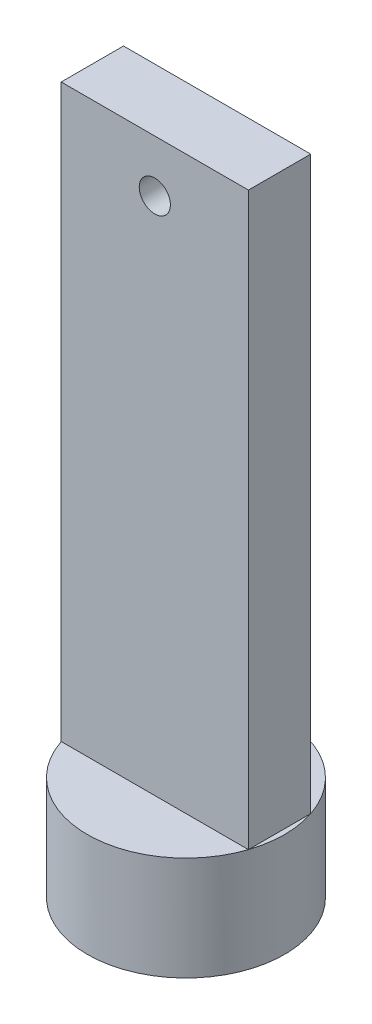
ISO-10303-21;
HEADER;
FILE_DESCRIPTION(('STEP AP214'),'2;1');
FILE_NAME('part.step','',(''),(''),'','','');
FILE_SCHEMA(('AUTOMOTIVE_DESIGN { 1 0 10303 214 1 1 1 1 }'));
ENDSEC;
DATA;
#1=APPLICATION_CONTEXT('core data for automotive mechanical design processes');
#2=APPLICATION_PROTOCOL_DEFINITION('international standard','automotive_design',2000,#1);
#3=PRODUCT_CONTEXT('',#1,'mechanical');
#4=PRODUCT('Part','Part','',(#3));
#5=PRODUCT_RELATED_PRODUCT_CATEGORY('part','',(#4));
#6=PRODUCT_DEFINITION_FORMATION('','',#4);
#7=PRODUCT_DEFINITION_CONTEXT('part definition',#1,'design');
#8=PRODUCT_DEFINITION('design','',#6,#7);
#9=PRODUCT_DEFINITION_SHAPE('','',#8);
#10=(LENGTH_UNIT() NAMED_UNIT(*) SI_UNIT(.MILLI.,.METRE.));
#11=(NAMED_UNIT(*) PLANE_ANGLE_UNIT() SI_UNIT($,.RADIAN.));
#12=(NAMED_UNIT(*) SI_UNIT($,.STERADIAN.) SOLID_ANGLE_UNIT());
#13=UNCERTAINTY_MEASURE_WITH_UNIT(LENGTH_MEASURE(1.E-05),#10,'distance_accuracy_value','');
#14=(GEOMETRIC_REPRESENTATION_CONTEXT(3) GLOBAL_UNCERTAINTY_ASSIGNED_CONTEXT((#13)) GLOBAL_UNIT_ASSIGNED_CONTEXT((#10,
#11,#12)) REPRESENTATION_CONTEXT('',''));
#15=CARTESIAN_POINT('',(0.,0.,0.));
#16=DIRECTION('',(0.,0.,1.));
#17=DIRECTION('',(1.,0.,0.));
#18=AXIS2_PLACEMENT_3D('',#15,#16,#17);
#19=CARTESIAN_POINT('',(0.,500.,0.));
#20=DIRECTION('',(0.,1.,0.));
#21=DIRECTION('',(0.,0.,1.));
#22=AXIS2_PLACEMENT_3D('',#19,#20,#21);
#23=PLANE('',#22);
#24=DIRECTION('',(0.,0.,1.));
#25=VECTOR('',#24,1.);
#26=CARTESIAN_POINT('',(-450.693909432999,500.,-150.));
#27=LINE('',#26,#25);
#28=CARTESIAN_POINT('',(-450.693909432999,500.,-150.));
#29=VERTEX_POINT('',#28);
#30=CARTESIAN_POINT('',(-450.693909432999,500.,150.));
#31=VERTEX_POINT('',#30);
#32=EDGE_CURVE('E56',#29,#31,#27,.T.);
#33=ORIENTED_EDGE('',*,*,#32,.F.);
#34=CARTESIAN_POINT('',(0.,500.,0.));
#35=DIRECTION('',(0.,1.,0.));
#36=DIRECTION('',(0.,0.,1.));
#37=AXIS2_PLACEMENT_3D('',#34,#35,#36);
#38=CIRCLE('',#37,475.);
#39=EDGE_CURVE('E114',#29,#31,#38,.T.);
#40=ORIENTED_EDGE('',*,*,#39,.T.);
#41=EDGE_LOOP('',(#33,#40));
#42=FACE_BOUND('',#41,.T.);
#43=ADVANCED_FACE('F32',(#42),#23,.T.);
#44=DIRECTION('',(-1.,0.,0.));
#45=VECTOR('',#44,1.);
#46=CARTESIAN_POINT('',(-450.693909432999,500.,-150.));
#47=LINE('',#46,#45);
#48=CARTESIAN_POINT('',(450.693909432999,500.,-150.));
#49=VERTEX_POINT('',#48);
#50=EDGE_CURVE('E97',#49,#29,#47,.T.);
#51=ORIENTED_EDGE('',*,*,#50,.F.);
#52=EDGE_CURVE('E41',#49,#29,#38,.T.);
#53=ORIENTED_EDGE('',*,*,#52,.T.);
#54=EDGE_LOOP('',(#51,#53));
#55=FACE_BOUND('',#54,.T.);
#56=ADVANCED_FACE('F120',(#55),#23,.T.);
#57=DIRECTION('',(0.,0.,-1.));
#58=VECTOR('',#57,1.);
#59=CARTESIAN_POINT('',(450.693909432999,500.,-150.));
#60=LINE('',#59,#58);
#61=CARTESIAN_POINT('',(450.693909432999,500.,150.));
#62=VERTEX_POINT('',#61);
#63=EDGE_CURVE('E127',#62,#49,#60,.T.);
#64=ORIENTED_EDGE('',*,*,#63,.F.);
#65=EDGE_CURVE('E11',#62,#49,#38,.T.);
#66=ORIENTED_EDGE('',*,*,#65,.T.);
#67=EDGE_LOOP('',(#64,#66));
#68=FACE_BOUND('',#67,.T.);
#69=ADVANCED_FACE('F162',(#68),#23,.T.);
#70=DIRECTION('',(1.,0.,0.));
#71=VECTOR('',#70,1.);
#72=CARTESIAN_POINT('',(-450.693909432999,500.,150.));
#73=LINE('',#72,#71);
#74=EDGE_CURVE('E49',#31,#62,#73,.T.);
#75=ORIENTED_EDGE('',*,*,#74,.F.);
#76=EDGE_CURVE('E43',#31,#62,#38,.T.);
#77=ORIENTED_EDGE('',*,*,#76,.T.);
#78=EDGE_LOOP('',(#75,#77));
#79=FACE_BOUND('',#78,.T.);
#80=ADVANCED_FACE('F158',(#79),#23,.T.);
#81=CARTESIAN_POINT('',(0.,0.,0.));
#82=DIRECTION('',(0.,1.,0.));
#83=DIRECTION('',(0.,0.,1.));
#84=AXIS2_PLACEMENT_3D('',#81,#82,#83);
#85=PLANE('',#84);
#86=CARTESIAN_POINT('',(0.,0.,0.));
#87=DIRECTION('',(0.,1.,0.));
#88=DIRECTION('',(0.,0.,1.));
#89=AXIS2_PLACEMENT_3D('',#86,#87,#88);
#90=CIRCLE('',#89,475.);
#91=CARTESIAN_POINT('',(0.,0.,475.));
#92=VERTEX_POINT('',#91);
#93=EDGE_CURVE('E110',#92,#92,#90,.T.);
#94=ORIENTED_EDGE('',*,*,#93,.F.);
#95=EDGE_LOOP('',(#94));
#96=FACE_BOUND('',#95,.T.);
#97=CARTESIAN_POINT('',(0.,0.,0.));
#98=DIRECTION('',(0.,1.,0.));
#99=DIRECTION('',(0.,0.,1.));
#100=AXIS2_PLACEMENT_3D('',#97,#98,#99);
#101=CIRCLE('',#100,45.5134517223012);
#102=CARTESIAN_POINT('',(0.,0.,45.5134517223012));
#103=VERTEX_POINT('',#102);
#104=EDGE_CURVE('E103',#103,#103,#101,.T.);
#105=ORIENTED_EDGE('',*,*,#104,.T.);
#106=EDGE_LOOP('',(#105));
#107=FACE_BOUND('',#106,.T.);
#108=ADVANCED_FACE('F165',(#96,#107),#85,.F.);
#109=CARTESIAN_POINT('',(0.,500.,0.));
#110=DIRECTION('',(0.,-1.,0.));
#111=DIRECTION('',(0.,0.,-1.));
#112=AXIS2_PLACEMENT_3D('',#109,#110,#111);
#113=CYLINDRICAL_SURFACE('',#112,475.);
#114=ORIENTED_EDGE('',*,*,#65,.F.);
#115=ORIENTED_EDGE('',*,*,#76,.F.);
#116=ORIENTED_EDGE('',*,*,#39,.F.);
#117=ORIENTED_EDGE('',*,*,#52,.F.);
#118=EDGE_LOOP('',(#114,#115,#116,#117));
#119=FACE_BOUND('',#118,.T.);
#120=ORIENTED_EDGE('',*,*,#93,.T.);
#121=EDGE_LOOP('',(#120));
#122=FACE_BOUND('',#121,.T.);
#123=ADVANCED_FACE('F34',(#119,#122),#113,.T.);
#124=CARTESIAN_POINT('',(0.,500.,0.));
#125=DIRECTION('',(0.,-1.,0.));
#126=DIRECTION('',(0.,0.,-1.));
#127=AXIS2_PLACEMENT_3D('',#124,#125,#126);
#128=CYLINDRICAL_SURFACE('',#127,45.5134517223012);
#129=CARTESIAN_POINT('',(0.,500.,0.));
#130=DIRECTION('',(0.,1.,0.));
#131=DIRECTION('',(0.,0.,1.));
#132=AXIS2_PLACEMENT_3D('',#129,#130,#131);
#133=CIRCLE('',#132,45.5134517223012);
#134=CARTESIAN_POINT('',(0.,500.,45.5134517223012));
#135=VERTEX_POINT('',#134);
#136=EDGE_CURVE('E100',#135,#135,#133,.T.);
#137=ORIENTED_EDGE('',*,*,#136,.T.);
#138=EDGE_LOOP('',(#137));
#139=FACE_BOUND('',#138,.T.);
#140=ORIENTED_EDGE('',*,*,#104,.F.);
#141=EDGE_LOOP('',(#140));
#142=FACE_BOUND('',#141,.T.);
#143=ADVANCED_FACE('F186',(#139,#142),#128,.F.);
#144=CARTESIAN_POINT('',(0.,3250.,0.));
#145=DIRECTION('',(0.,1.,0.));
#146=DIRECTION('',(0.,0.,1.));
#147=AXIS2_PLACEMENT_3D('',#144,#145,#146);
#148=PLANE('',#147);
#149=DIRECTION('',(0.,0.,1.));
#150=VECTOR('',#149,1.);
#151=CARTESIAN_POINT('',(-450.693909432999,3250.,-150.));
#152=LINE('',#151,#150);
#153=CARTESIAN_POINT('',(-450.693909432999,3250.,-150.));
#154=VERTEX_POINT('',#153);
#155=CARTESIAN_POINT('',(-450.693909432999,3250.,150.));
#156=VERTEX_POINT('',#155);
#157=EDGE_CURVE('E88',#154,#156,#152,.T.);
#158=ORIENTED_EDGE('',*,*,#157,.T.);
#159=DIRECTION('',(1.,0.,0.));
#160=VECTOR('',#159,1.);
#161=CARTESIAN_POINT('',(-450.693909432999,3250.,150.));
#162=LINE('',#161,#160);
#163=CARTESIAN_POINT('',(450.693909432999,3250.,150.));
#164=VERTEX_POINT('',#163);
#165=EDGE_CURVE('E78',#156,#164,#162,.T.);
#166=ORIENTED_EDGE('',*,*,#165,.T.);
#167=DIRECTION('',(0.,0.,-1.));
#168=VECTOR('',#167,1.);
#169=CARTESIAN_POINT('',(450.693909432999,3250.,-150.));
#170=LINE('',#169,#168);
#171=CARTESIAN_POINT('',(450.693909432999,3250.,-150.));
#172=VERTEX_POINT('',#171);
#173=EDGE_CURVE('E87',#164,#172,#170,.T.);
#174=ORIENTED_EDGE('',*,*,#173,.T.);
#175=DIRECTION('',(-1.,0.,0.));
#176=VECTOR('',#175,1.);
#177=CARTESIAN_POINT('',(-450.693909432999,3250.,-150.));
#178=LINE('',#177,#176);
#179=EDGE_CURVE('E93',#172,#154,#178,.T.);
#180=ORIENTED_EDGE('',*,*,#179,.T.);
#181=EDGE_LOOP('',(#158,#166,#174,#180));
#182=FACE_BOUND('',#181,.T.);
#183=ADVANCED_FACE('F91',(#182),#148,.T.);
#184=CARTESIAN_POINT('',(-450.693909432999,3250.,-150.));
#185=DIRECTION('',(0.,0.,1.));
#186=DIRECTION('',(1.,0.,0.));
#187=AXIS2_PLACEMENT_3D('',#184,#185,#186);
#188=PLANE('',#187);
#189=CARTESIAN_POINT('',(0.,3000.,-150.));
#190=DIRECTION('',(0.,0.,1.));
#191=DIRECTION('',(1.,0.,0.));
#192=AXIS2_PLACEMENT_3D('',#189,#190,#191);
#193=CIRCLE('',#192,75.);
#194=CARTESIAN_POINT('',(75.,3000.,-150.));
#195=VERTEX_POINT('',#194);
#196=EDGE_CURVE('E135',#195,#195,#193,.T.);
#197=ORIENTED_EDGE('',*,*,#196,.T.);
#198=EDGE_LOOP('',(#197));
#199=FACE_BOUND('',#198,.T.);
#200=ORIENTED_EDGE('',*,*,#50,.T.);
#201=DIRECTION('',(0.,-1.,0.));
#202=VECTOR('',#201,1.);
#203=CARTESIAN_POINT('',(-450.693909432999,3250.,-150.));
#204=LINE('',#203,#202);
#205=EDGE_CURVE('E125',#154,#29,#204,.T.);
#206=ORIENTED_EDGE('',*,*,#205,.F.);
#207=ORIENTED_EDGE('',*,*,#179,.F.);
#208=DIRECTION('',(0.,-1.,0.));
#209=VECTOR('',#208,1.);
#210=CARTESIAN_POINT('',(450.693909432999,3250.,-150.));
#211=LINE('',#210,#209);
#212=EDGE_CURVE('E105',#172,#49,#211,.T.);
#213=ORIENTED_EDGE('',*,*,#212,.T.);
#214=EDGE_LOOP('',(#200,#206,#207,#213));
#215=FACE_BOUND('',#214,.T.);
#216=ADVANCED_FACE('F124',(#199,#215),#188,.F.);
#217=CARTESIAN_POINT('',(450.693909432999,3250.,-150.));
#218=DIRECTION('',(-1.,0.,0.));
#219=DIRECTION('',(0.,0.,1.));
#220=AXIS2_PLACEMENT_3D('',#217,#218,#219);
#221=PLANE('',#220);
#222=ORIENTED_EDGE('',*,*,#63,.T.);
#223=ORIENTED_EDGE('',*,*,#212,.F.);
#224=ORIENTED_EDGE('',*,*,#173,.F.);
#225=DIRECTION('',(0.,-1.,0.));
#226=VECTOR('',#225,1.);
#227=CARTESIAN_POINT('',(450.693909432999,3250.,150.));
#228=LINE('',#227,#226);
#229=EDGE_CURVE('E84',#164,#62,#228,.T.);
#230=ORIENTED_EDGE('',*,*,#229,.T.);
#231=EDGE_LOOP('',(#222,#223,#224,#230));
#232=FACE_BOUND('',#231,.T.);
#233=ADVANCED_FACE('F175',(#232),#221,.F.);
#234=CARTESIAN_POINT('',(-450.693909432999,3250.,150.));
#235=DIRECTION('',(0.,0.,-1.));
#236=DIRECTION('',(-1.,0.,0.));
#237=AXIS2_PLACEMENT_3D('',#234,#235,#236);
#238=PLANE('',#237);
#239=CARTESIAN_POINT('',(0.,3000.,150.));
#240=DIRECTION('',(0.,0.,-1.));
#241=DIRECTION('',(-1.,0.,0.));
#242=AXIS2_PLACEMENT_3D('',#239,#240,#241);
#243=CIRCLE('',#242,75.);
#244=CARTESIAN_POINT('',(-75.,3000.,150.));
#245=VERTEX_POINT('',#244);
#246=EDGE_CURVE('E36',#245,#245,#243,.T.);
#247=ORIENTED_EDGE('',*,*,#246,.T.);
#248=EDGE_LOOP('',(#247));
#249=FACE_BOUND('',#248,.T.);
#250=ORIENTED_EDGE('',*,*,#74,.T.);
#251=ORIENTED_EDGE('',*,*,#229,.F.);
#252=ORIENTED_EDGE('',*,*,#165,.F.);
#253=DIRECTION('',(0.,-1.,0.));
#254=VECTOR('',#253,1.);
#255=CARTESIAN_POINT('',(-450.693909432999,3250.,150.));
#256=LINE('',#255,#254);
#257=EDGE_CURVE('E82',#156,#31,#256,.T.);
#258=ORIENTED_EDGE('',*,*,#257,.T.);
#259=EDGE_LOOP('',(#250,#251,#252,#258));
#260=FACE_BOUND('',#259,.T.);
#261=ADVANCED_FACE('F80',(#249,#260),#238,.F.);
#262=CARTESIAN_POINT('',(-450.693909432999,3250.,-150.));
#263=DIRECTION('',(1.,0.,0.));
#264=DIRECTION('',(0.,0.,-1.));
#265=AXIS2_PLACEMENT_3D('',#262,#263,#264);
#266=PLANE('',#265);
#267=ORIENTED_EDGE('',*,*,#32,.T.);
#268=ORIENTED_EDGE('',*,*,#257,.F.);
#269=ORIENTED_EDGE('',*,*,#157,.F.);
#270=ORIENTED_EDGE('',*,*,#205,.T.);
#271=EDGE_LOOP('',(#267,#268,#269,#270));
#272=FACE_BOUND('',#271,.T.);
#273=ADVANCED_FACE('F99',(#272),#266,.F.);
#274=CARTESIAN_POINT('',(0.,500.,0.));
#275=DIRECTION('',(0.,1.,0.));
#276=DIRECTION('',(0.,0.,1.));
#277=AXIS2_PLACEMENT_3D('',#274,#275,#276);
#278=PLANE('',#277);
#279=ORIENTED_EDGE('',*,*,#136,.F.);
#280=EDGE_LOOP('',(#279));
#281=FACE_BOUND('',#280,.T.);
#282=ADVANCED_FACE('F148',(#281),#278,.F.);
#283=CARTESIAN_POINT('',(0.,3000.,-1500.));
#284=DIRECTION('',(0.,0.,1.));
#285=DIRECTION('',(1.,0.,0.));
#286=AXIS2_PLACEMENT_3D('',#283,#284,#285);
#287=CYLINDRICAL_SURFACE('',#286,75.);
#288=ORIENTED_EDGE('',*,*,#246,.F.);
#289=EDGE_LOOP('',(#288));
#290=FACE_BOUND('',#289,.T.);
#291=ORIENTED_EDGE('',*,*,#196,.F.);
#292=EDGE_LOOP('',(#291));
#293=FACE_BOUND('',#292,.T.);
#294=ADVANCED_FACE('F145',(#290,#293),#287,.F.);
#295=CLOSED_SHELL('',(#43,#56,#69,#80,#108,#123,#143,#183,#216,#233,#261,#273,#282,#294));
#296=MANIFOLD_SOLID_BREP('B2',#295);
#297=ADVANCED_BREP_SHAPE_REPRESENTATION('',(#18,#296),#14);
#298=SHAPE_DEFINITION_REPRESENTATION(#9,#297);
ENDSEC;
END-ISO-10303-21;
